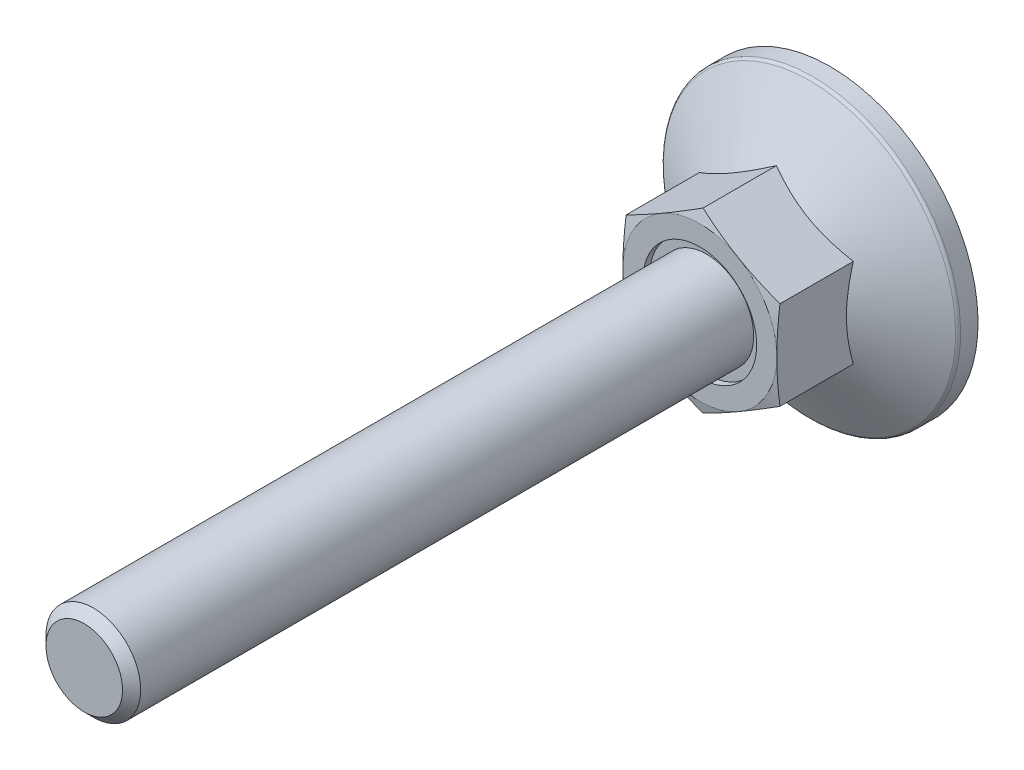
ISO-10303-21;
HEADER;
FILE_DESCRIPTION(('STEP AP214'),'2;1');
FILE_NAME('part.step','',(''),(''),'','','');
FILE_SCHEMA(('AUTOMOTIVE_DESIGN { 1 0 10303 214 1 1 1 1 }'));
ENDSEC;
DATA;
#1=APPLICATION_CONTEXT('core data for automotive mechanical design processes');
#2=APPLICATION_PROTOCOL_DEFINITION('international standard','automotive_design',2000,#1);
#3=PRODUCT_CONTEXT('',#1,'mechanical');
#4=PRODUCT('Part','Part','',(#3));
#5=PRODUCT_RELATED_PRODUCT_CATEGORY('part','',(#4));
#6=PRODUCT_DEFINITION_FORMATION('','',#4);
#7=PRODUCT_DEFINITION_CONTEXT('part definition',#1,'design');
#8=PRODUCT_DEFINITION('design','',#6,#7);
#9=PRODUCT_DEFINITION_SHAPE('','',#8);
#10=(LENGTH_UNIT() NAMED_UNIT(*) SI_UNIT(.MILLI.,.METRE.));
#11=(NAMED_UNIT(*) PLANE_ANGLE_UNIT() SI_UNIT($,.RADIAN.));
#12=(NAMED_UNIT(*) SI_UNIT($,.STERADIAN.) SOLID_ANGLE_UNIT());
#13=UNCERTAINTY_MEASURE_WITH_UNIT(LENGTH_MEASURE(1.E-05),#10,'distance_accuracy_value','');
#14=(GEOMETRIC_REPRESENTATION_CONTEXT(3) GLOBAL_UNCERTAINTY_ASSIGNED_CONTEXT((#13)) GLOBAL_UNIT_ASSIGNED_CONTEXT((#10,
#11,#12)) REPRESENTATION_CONTEXT('',''));
#15=CARTESIAN_POINT('',(0.,0.,0.));
#16=DIRECTION('',(0.,0.,1.));
#17=DIRECTION('',(1.,0.,0.));
#18=AXIS2_PLACEMENT_3D('',#15,#16,#17);
#19=CARTESIAN_POINT('',(0.,0.,10.45));
#20=DIRECTION('',(0.,0.,-1.));
#21=DIRECTION('',(0.,1.,0.));
#22=AXIS2_PLACEMENT_3D('',#19,#20,#21);
#23=PLANE('',#22);
#24=CARTESIAN_POINT('',(0.,0.,10.45));
#25=DIRECTION('',(0.,0.,-1.));
#26=DIRECTION('',(0.,1.,0.));
#27=AXIS2_PLACEMENT_3D('',#24,#25,#26);
#28=CIRCLE('',#27,4.8);
#29=CARTESIAN_POINT('',(0.,4.8,10.45));
#30=VERTEX_POINT('',#29);
#31=EDGE_CURVE('E27',#30,#30,#28,.T.);
#32=ORIENTED_EDGE('',*,*,#31,.F.);
#33=EDGE_LOOP('',(#32));
#34=FACE_BOUND('',#33,.T.);
#35=CARTESIAN_POINT('',(0.,0.,10.45));
#36=DIRECTION('',(0.,0.,-1.));
#37=DIRECTION('',(0.,1.,0.));
#38=AXIS2_PLACEMENT_3D('',#35,#36,#37);
#39=CIRCLE('',#38,4.);
#40=CARTESIAN_POINT('',(0.,4.,10.45));
#41=VERTEX_POINT('',#40);
#42=EDGE_CURVE('E252',#41,#41,#39,.F.);
#43=ORIENTED_EDGE('',*,*,#42,.F.);
#44=EDGE_LOOP('',(#43));
#45=FACE_BOUND('',#44,.T.);
#46=ADVANCED_FACE('F14',(#34,#45),#23,.F.);
#47=CARTESIAN_POINT('',(0.,7.5055534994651,22.));
#48=DIRECTION('',(0.499999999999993,-0.866025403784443,0.));
#49=DIRECTION('',(0.866025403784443,0.499999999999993,0.));
#50=AXIS2_PLACEMENT_3D('',#47,#48,#49);
#51=PLANE('',#50);
#52=CARTESIAN_POINT('',(-6.5002,3.75266127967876,4.53347836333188));
#53=CARTESIAN_POINT('',(-6.35732254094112,3.83515161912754,4.58109719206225));
#54=CARTESIAN_POINT('',(-6.21391236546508,3.91794952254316,4.62655491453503));
#55=CARTESIAN_POINT('',(-5.9259273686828,4.08421773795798,4.71255293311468));
#56=CARTESIAN_POINT('',(-5.78135207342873,4.16768832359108,4.7530911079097));
#57=CARTESIAN_POINT('',(-5.34531134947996,4.41943655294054,4.86653061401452));
#58=CARTESIAN_POINT('',(-5.05212471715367,4.58870793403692,4.93105380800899));
#59=CARTESIAN_POINT('',(-4.61337625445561,4.84201947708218,5.00671503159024));
#60=CARTESIAN_POINT('',(-4.46912536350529,4.92530276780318,5.02826875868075));
#61=CARTESIAN_POINT('',(-4.17997178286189,5.09224566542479,5.06441130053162));
#62=CARTESIAN_POINT('',(-4.03506915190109,5.17590523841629,5.07900073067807));
#63=CARTESIAN_POINT('',(-3.74501222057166,5.34336968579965,5.10084286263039));
#64=CARTESIAN_POINT('',(-3.59985839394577,5.42717428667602,5.10810389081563));
#65=CARTESIAN_POINT('',(-3.30942466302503,5.59485627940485,5.11514131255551));
#66=CARTESIAN_POINT('',(-3.16414476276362,5.67873366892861,5.11491793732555));
#67=CARTESIAN_POINT('',(-2.76612405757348,5.90853103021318,5.1040181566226));
#68=CARTESIAN_POINT('',(-2.51351353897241,6.05437578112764,5.08571979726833));
#69=CARTESIAN_POINT('',(-2.00997032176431,6.34509659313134,5.02769527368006));
#70=CARTESIAN_POINT('',(-1.75903939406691,6.48997163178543,4.9879492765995));
#71=CARTESIAN_POINT('',(-1.25448277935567,6.78127752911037,4.8885957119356));
#72=CARTESIAN_POINT('',(-1.00092075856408,6.92767163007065,4.82856718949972));
#73=CARTESIAN_POINT('',(-0.497578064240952,7.21827667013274,4.69232662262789));
#74=CARTESIAN_POINT('',(-0.247790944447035,7.36249133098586,4.61614658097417));
#75=CARTESIAN_POINT('',(0.000200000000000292,7.50566896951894,4.53347836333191));
#76=B_SPLINE_CURVE_WITH_KNOTS('',3,(#52,#53,#54,#55,#56,#57,#58,#59,#60,#61,#62,#63,#64,#65,#66,
#67,#68,#69,#70,#71,#72,#73,#74,#75),.UNSPECIFIED.,.F.,.F.,(4,2,2,2,2,2,2,2,2,2,2,4),(0.,
0.515105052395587,1.03043143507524,2.06322554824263,2.56697389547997,3.07067772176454,
3.57380860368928,4.07692394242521,4.95279354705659,5.82947446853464,6.72559912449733,
7.61996451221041),.UNSPECIFIED.);
#77=CARTESIAN_POINT('',(-6.5,3.7527767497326,4.53354503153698));
#78=VERTEX_POINT('',#77);
#79=CARTESIAN_POINT('',(0.,7.5055534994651,4.53354503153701));
#80=VERTEX_POINT('',#79);
#81=EDGE_CURVE('E100',#78,#80,#76,.T.);
#82=ORIENTED_EDGE('',*,*,#81,.F.);
#83=DIRECTION('',(0.,0.,-1.));
#84=VECTOR('',#83,1.);
#85=CARTESIAN_POINT('',(-6.5,3.7527767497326,22.));
#86=LINE('',#85,#84);
#87=CARTESIAN_POINT('',(-6.5,3.7527767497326,10.7305627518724));
#88=VERTEX_POINT('',#87);
#89=EDGE_CURVE('E91',#88,#78,#86,.T.);
#90=ORIENTED_EDGE('',*,*,#89,.F.);
#91=CARTESIAN_POINT('',(0.000200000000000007,7.50566896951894,10.7305318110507));
#92=CARTESIAN_POINT('',(-0.269745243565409,7.34981601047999,10.7723102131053));
#93=CARTESIAN_POINT('',(-0.540179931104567,7.19368047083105,10.8102381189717));
#94=CARTESIAN_POINT('',(-1.08200437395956,6.8808579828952,10.876873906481));
#95=CARTESIAN_POINT('',(-1.35339447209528,6.72417083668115,10.9055780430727));
#96=CARTESIAN_POINT('',(-1.89548428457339,6.41119513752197,10.952090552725));
#97=CARTESIAN_POINT('',(-2.16618033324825,6.25490870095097,10.9699543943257));
#98=CARTESIAN_POINT('',(-2.70791763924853,5.94213652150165,10.9939079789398));
#99=CARTESIAN_POINT('',(-2.97895881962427,5.78565082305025,11.));
#100=CARTESIAN_POINT('',(-3.52104118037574,5.47267942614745,11.));
#101=CARTESIAN_POINT('',(-3.79208236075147,5.31619372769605,10.9939079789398));
#102=CARTESIAN_POINT('',(-4.33381966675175,5.00342154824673,10.9699543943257));
#103=CARTESIAN_POINT('',(-4.60451571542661,4.84713511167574,10.952090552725));
#104=CARTESIAN_POINT('',(-5.14660552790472,4.53415941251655,10.9055780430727));
#105=CARTESIAN_POINT('',(-5.41799562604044,4.3774722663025,10.876873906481));
#106=CARTESIAN_POINT('',(-5.95982006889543,4.06464977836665,10.8102381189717));
#107=CARTESIAN_POINT('',(-6.23025475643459,3.90851423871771,10.7723102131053));
#108=CARTESIAN_POINT('',(-6.5002,3.75266127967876,10.7305318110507));
#109=B_SPLINE_CURVE_WITH_KNOTS('',3,(#91,#92,#93,#94,#95,#96,#97,#98,#99,#100,#101,#102,#103,
#104,#105,#106,#107,#108),.UNSPECIFIED.,.F.,.F.,(4,2,2,2,2,2,2,2,4),(0.,0.943529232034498,
1.88744107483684,2.82648138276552,3.76533995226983,4.70419852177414,5.64323882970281,
6.58715067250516,7.53067990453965),.UNSPECIFIED.);
#110=CARTESIAN_POINT('',(-3.24999999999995,5.62916512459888,11.));
#111=VERTEX_POINT('',#110);
#112=EDGE_CURVE('E191',#111,#88,#109,.T.);
#113=ORIENTED_EDGE('',*,*,#112,.F.);
#114=CARTESIAN_POINT('',(0.,7.5055534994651,10.7305627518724));
#115=VERTEX_POINT('',#114);
#116=EDGE_CURVE('E478',#115,#111,#109,.T.);
#117=ORIENTED_EDGE('',*,*,#116,.F.);
#118=DIRECTION('',(0.,0.,-1.));
#119=VECTOR('',#118,1.);
#120=CARTESIAN_POINT('',(0.,7.5055534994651,22.));
#121=LINE('',#120,#119);
#122=EDGE_CURVE('E104',#115,#80,#121,.T.);
#123=ORIENTED_EDGE('',*,*,#122,.T.);
#124=EDGE_LOOP('',(#82,#90,#113,#117,#123));
#125=FACE_BOUND('',#124,.T.);
#126=ADVANCED_FACE('F103',(#125),#51,.F.);
#127=CARTESIAN_POINT('',(6.5,3.7527767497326,22.));
#128=DIRECTION('',(-0.499999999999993,-0.866025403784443,0.));
#129=DIRECTION('',(0.866025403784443,-0.499999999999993,0.));
#130=AXIS2_PLACEMENT_3D('',#127,#128,#129);
#131=PLANE('',#130);
#132=CARTESIAN_POINT('',(-0.0002,7.50566896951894,4.53347836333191));
#133=CARTESIAN_POINT('',(0.142677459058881,7.42317863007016,4.58109719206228));
#134=CARTESIAN_POINT('',(0.286087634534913,7.34038072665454,4.62655491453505));
#135=CARTESIAN_POINT('',(0.574072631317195,7.17411251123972,4.71255293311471));
#136=CARTESIAN_POINT('',(0.718647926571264,7.09064192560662,4.75309110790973));
#137=CARTESIAN_POINT('',(1.15468865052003,6.83889369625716,4.86653061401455));
#138=CARTESIAN_POINT('',(1.44787528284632,6.66962231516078,4.93105380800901));
#139=CARTESIAN_POINT('',(1.88662374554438,6.41631077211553,5.00671503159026));
#140=CARTESIAN_POINT('',(2.03087463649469,6.33302748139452,5.02826875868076));
#141=CARTESIAN_POINT('',(2.32002821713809,6.16608458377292,5.06441130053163));
#142=CARTESIAN_POINT('',(2.46493084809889,6.08242501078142,5.07900073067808));
#143=CARTESIAN_POINT('',(2.75498777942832,5.91496056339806,5.10084286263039));
#144=CARTESIAN_POINT('',(2.90014160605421,5.8311559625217,5.10810389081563));
#145=CARTESIAN_POINT('',(3.19057533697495,5.66347396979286,5.11514131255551));
#146=CARTESIAN_POINT('',(3.33585523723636,5.5795965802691,5.11491793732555));
#147=CARTESIAN_POINT('',(3.73387594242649,5.34979921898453,5.10401815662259));
#148=CARTESIAN_POINT('',(3.98648646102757,5.20395446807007,5.08571979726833));
#149=CARTESIAN_POINT('',(4.49002967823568,4.91323365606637,5.02769527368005));
#150=CARTESIAN_POINT('',(4.74096060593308,4.76835861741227,4.98794927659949));
#151=CARTESIAN_POINT('',(5.24551722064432,4.47705272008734,4.88859571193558));
#152=CARTESIAN_POINT('',(5.49907924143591,4.33065861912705,4.8285671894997));
#153=CARTESIAN_POINT('',(6.00242193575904,4.04005357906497,4.69232662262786));
#154=CARTESIAN_POINT('',(6.25220905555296,3.89583891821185,4.61614658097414));
#155=CARTESIAN_POINT('',(6.5002,3.75266127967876,4.53347836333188));
#156=B_SPLINE_CURVE_WITH_KNOTS('',3,(#132,#133,#134,#135,#136,#137,#138,#139,#140,#141,#142,
#143,#144,#145,#146,#147,#148,#149,#150,#151,#152,#153,#154,#155),.UNSPECIFIED.,.F.,.F.,(4,2,2,
2,2,2,2,2,2,2,2,4),(0.,0.515105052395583,1.03043143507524,2.06322554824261,2.56697389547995,
3.07067772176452,3.57380860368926,4.07692394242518,4.95279354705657,5.82947446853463,
6.72559912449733,7.61996451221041),.UNSPECIFIED.);
#157=CARTESIAN_POINT('',(6.5,3.7527767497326,4.53354503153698));
#158=VERTEX_POINT('',#157);
#159=EDGE_CURVE('E34',#80,#158,#156,.T.);
#160=ORIENTED_EDGE('',*,*,#159,.F.);
#161=ORIENTED_EDGE('',*,*,#122,.F.);
#162=CARTESIAN_POINT('',(6.5002,3.75266127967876,10.7305318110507));
#163=CARTESIAN_POINT('',(6.23025475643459,3.90851423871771,10.7723102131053));
#164=CARTESIAN_POINT('',(5.95982006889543,4.06464977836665,10.8102381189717));
#165=CARTESIAN_POINT('',(5.41799562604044,4.37747226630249,10.876873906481));
#166=CARTESIAN_POINT('',(5.14660552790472,4.53415941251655,10.9055780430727));
#167=CARTESIAN_POINT('',(4.60451571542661,4.84713511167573,10.952090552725));
#168=CARTESIAN_POINT('',(4.33381966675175,5.00342154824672,10.9699543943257));
#169=CARTESIAN_POINT('',(3.79208236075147,5.31619372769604,10.9939079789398));
#170=CARTESIAN_POINT('',(3.52104118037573,5.47267942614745,11.));
#171=CARTESIAN_POINT('',(2.97895881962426,5.78565082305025,11.));
#172=CARTESIAN_POINT('',(2.70791763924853,5.94213652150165,10.9939079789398));
#173=CARTESIAN_POINT('',(2.16618033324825,6.25490870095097,10.9699543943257));
#174=CARTESIAN_POINT('',(1.89548428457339,6.41119513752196,10.952090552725));
#175=CARTESIAN_POINT('',(1.35339447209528,6.72417083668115,10.9055780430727));
#176=CARTESIAN_POINT('',(1.08200437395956,6.8808579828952,10.876873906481));
#177=CARTESIAN_POINT('',(0.540179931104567,7.19368047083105,10.8102381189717));
#178=CARTESIAN_POINT('',(0.26974524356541,7.34981601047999,10.7723102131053));
#179=CARTESIAN_POINT('',(-0.000199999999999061,7.50566896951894,10.7305318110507));
#180=B_SPLINE_CURVE_WITH_KNOTS('',3,(#162,#163,#164,#165,#166,#167,#168,#169,#170,#171,#172,
#173,#174,#175,#176,#177,#178,#179),.UNSPECIFIED.,.F.,.F.,(4,2,2,2,2,2,2,2,4),(0.,
0.943529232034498,1.88744107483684,2.82648138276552,3.76533995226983,4.70419852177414,
5.64323882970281,6.58715067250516,7.53067990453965),.UNSPECIFIED.);
#181=CARTESIAN_POINT('',(3.24999999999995,5.62916512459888,11.));
#182=VERTEX_POINT('',#181);
#183=EDGE_CURVE('E175',#182,#115,#180,.T.);
#184=ORIENTED_EDGE('',*,*,#183,.F.);
#185=CARTESIAN_POINT('',(6.5,3.7527767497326,10.7305627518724));
#186=VERTEX_POINT('',#185);
#187=EDGE_CURVE('E183',#186,#182,#180,.T.);
#188=ORIENTED_EDGE('',*,*,#187,.F.);
#189=DIRECTION('',(0.,0.,-1.));
#190=VECTOR('',#189,1.);
#191=CARTESIAN_POINT('',(6.5,3.7527767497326,22.));
#192=LINE('',#191,#190);
#193=EDGE_CURVE('E481',#186,#158,#192,.T.);
#194=ORIENTED_EDGE('',*,*,#193,.T.);
#195=EDGE_LOOP('',(#160,#161,#184,#188,#194));
#196=FACE_BOUND('',#195,.T.);
#197=ADVANCED_FACE('F165',(#196),#131,.F.);
#198=CARTESIAN_POINT('',(6.5,-3.7527767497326,22.));
#199=DIRECTION('',(-1.,0.,0.));
#200=DIRECTION('',(0.,-1.,0.));
#201=AXIS2_PLACEMENT_3D('',#198,#199,#200);
#202=PLANE('',#201);
#203=CARTESIAN_POINT('',(6.5,10.067414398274,1.94823609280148));
#204=CARTESIAN_POINT('',(6.5,9.78352438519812,2.0858958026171));
#205=CARTESIAN_POINT('',(6.5,9.49898106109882,2.22223138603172));
#206=CARTESIAN_POINT('',(6.5,8.9282401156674,2.49150895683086));
#207=CARTESIAN_POINT('',(6.5,8.64204224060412,2.62445040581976));
#208=CARTESIAN_POINT('',(6.5,8.06616487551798,2.88686541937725));
#209=CARTESIAN_POINT('',(6.5,7.77647490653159,3.01631606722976));
#210=CARTESIAN_POINT('',(6.5,7.19478507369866,3.26989907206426));
#211=CARTESIAN_POINT('',(6.5,6.90278532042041,3.3940316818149));
#212=CARTESIAN_POINT('',(6.5,6.30684739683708,3.6393457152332));
#213=CARTESIAN_POINT('',(6.5,6.00282105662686,3.76031411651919));
#214=CARTESIAN_POINT('',(6.5,5.39120706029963,3.99306391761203));
#215=CARTESIAN_POINT('',(6.5,5.08361900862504,4.10484428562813));
#216=CARTESIAN_POINT('',(6.5,4.46497231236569,4.31627594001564));
#217=CARTESIAN_POINT('',(6.5,4.15392216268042,4.41595183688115));
#218=CARTESIAN_POINT('',(6.5,3.52735818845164,4.59996747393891));
#219=CARTESIAN_POINT('',(6.5,3.21184580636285,4.6843120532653));
#220=CARTESIAN_POINT('',(6.5,2.57783458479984,4.83319256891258));
#221=CARTESIAN_POINT('',(6.5,2.25935972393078,4.8978289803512));
#222=CARTESIAN_POINT('',(6.5,1.61842059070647,5.00357646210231));
#223=CARTESIAN_POINT('',(6.5,1.29595672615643,5.04468991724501));
#224=CARTESIAN_POINT('',(6.5,0.812693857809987,5.08598811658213));
#225=CARTESIAN_POINT('',(6.5,0.652724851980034,5.09635596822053));
#226=CARTESIAN_POINT('',(6.5,0.332484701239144,5.110324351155));
#227=CARTESIAN_POINT('',(6.5,0.172213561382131,5.11392499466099));
#228=CARTESIAN_POINT('',(6.5,-0.148338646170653,5.11426557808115));
#229=CARTESIAN_POINT('',(6.5,-0.308619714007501,5.11100536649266));
#230=CARTESIAN_POINT('',(6.5,-0.628902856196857,5.09770543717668));
#231=CARTESIAN_POINT('',(6.5,-0.788904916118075,5.08766537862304));
#232=CARTESIAN_POINT('',(6.5,-1.1736673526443,5.05558094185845));
#233=CARTESIAN_POINT('',(6.5,-1.39816400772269,5.03030719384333));
#234=CARTESIAN_POINT('',(6.5,-1.84547349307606,4.96779217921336));
#235=CARTESIAN_POINT('',(6.5,-2.06828609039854,4.93054928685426));
#236=CARTESIAN_POINT('',(6.5,-2.73393776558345,4.80284369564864));
#237=CARTESIAN_POINT('',(6.5,-3.17375537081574,4.69642628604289));
#238=CARTESIAN_POINT('',(6.5,-3.83171733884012,4.51203063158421));
#239=CARTESIAN_POINT('',(6.5,-4.0532725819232,4.44552609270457));
#240=CARTESIAN_POINT('',(6.5,-4.49422901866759,4.30565892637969));
#241=CARTESIAN_POINT('',(6.5,-4.7136301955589,4.23229624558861));
#242=CARTESIAN_POINT('',(6.5,-5.15035386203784,4.07988627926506));
#243=CARTESIAN_POINT('',(6.5,-5.36767698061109,4.00084077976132));
#244=CARTESIAN_POINT('',(6.5,-5.800520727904,3.83799065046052));
#245=CARTESIAN_POINT('',(6.5,-6.01604140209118,3.75418614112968));
#246=CARTESIAN_POINT('',(6.5,-6.61842771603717,3.5135303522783));
#247=CARTESIAN_POINT('',(6.5,-7.00350435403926,3.35220459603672));
#248=CARTESIAN_POINT('',(6.5,-7.76959629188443,3.02014813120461));
#249=CARTESIAN_POINT('',(6.5,-8.15061109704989,2.84941629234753));
#250=CARTESIAN_POINT('',(6.5,-8.90957192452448,2.50088582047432));
#251=CARTESIAN_POINT('',(6.5,-9.28751663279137,2.32308433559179));
#252=CARTESIAN_POINT('',(6.5,-10.0408394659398,1.96218611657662));
#253=CARTESIAN_POINT('',(6.5,-10.4162177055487,1.77908962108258));
#254=CARTESIAN_POINT('',(6.5,-11.1655631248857,1.40849620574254));
#255=CARTESIAN_POINT('',(6.5,-11.5395269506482,1.22099251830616));
#256=CARTESIAN_POINT('',(6.5,-12.2858210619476,0.842758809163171));
#257=CARTESIAN_POINT('',(6.5,-12.6581513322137,0.652028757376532));
#258=CARTESIAN_POINT('',(6.5,-13.4013949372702,0.268043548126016));
#259=CARTESIAN_POINT('',(6.5,-13.7723085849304,0.0747889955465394));
#260=CARTESIAN_POINT('',(6.5,-14.5130449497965,-0.313800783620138));
#261=CARTESIAN_POINT('',(6.5,-14.8828676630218,-0.509136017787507));
#262=CARTESIAN_POINT('',(6.5,-15.9085714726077,-1.05391022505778));
#263=CARTESIAN_POINT('',(6.5,-16.5634819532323,-1.40517623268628));
#264=CARTESIAN_POINT('',(6.5,-17.871267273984,-2.11157255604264));
#265=CARTESIAN_POINT('',(6.5,-18.5241419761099,-2.46670312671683));
#266=CARTESIAN_POINT('',(6.5,-19.8261496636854,-3.17862531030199));
#267=CARTESIAN_POINT('',(6.5,-20.4752878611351,-3.53540739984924));
#268=CARTESIAN_POINT('',(6.5,-21.7722968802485,-4.25114422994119));
#269=CARTESIAN_POINT('',(6.5,-22.4201678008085,-4.61009879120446));
#270=CARTESIAN_POINT('',(6.5,-23.0675997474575,-4.9698379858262));
#271=B_SPLINE_CURVE_WITH_KNOTS('',3,(#203,#204,#205,#206,#207,#208,#209,#210,#211,#212,#213,
#214,#215,#216,#217,#218,#219,#220,#221,#222,#223,#224,#225,#226,#227,#228,#229,#230,#231,#232,
#233,#234,#235,#236,#237,#238,#239,#240,#241,#242,#243,#244,#245,#246,#247,#248,#249,#250,#251,
#252,#253,#254,#255,#256,#257,#258,#259,#260,#261,#262,#263,#264,#265,#266,#267,#268,#269,#270),
.UNSPECIFIED.,.F.,.F.,(4,2,2,2,2,2,2,2,2,2,2,2,2,2,2,2,2,2,2,2,2,2,2,2,2,2,2,2,2,2,2,2,2,4),(0.,
0.94652822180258,1.89320566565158,2.84505559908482,3.79686024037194,4.77837094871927,
5.75999172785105,6.73958204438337,7.71886262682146,8.69306383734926,9.66716626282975,
10.1479587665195,10.6287432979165,11.1095384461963,11.5903577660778,12.267719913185,
12.9451741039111,14.3007885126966,14.9946950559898,15.6886069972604,16.3823017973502,
17.0759790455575,18.3282990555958,19.5807698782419,20.8337511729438,22.086676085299,
23.3416700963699,24.5966758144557,25.8513861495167,27.1061010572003,29.3355785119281,
31.5652039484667,33.7873748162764,36.0093647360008),.UNSPECIFIED.);
#272=CARTESIAN_POINT('',(6.5,-3.7527767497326,4.53354503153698));
#273=VERTEX_POINT('',#272);
#274=EDGE_CURVE('E42',#158,#273,#271,.T.);
#275=ORIENTED_EDGE('',*,*,#274,.F.);
#276=ORIENTED_EDGE('',*,*,#193,.F.);
#277=CARTESIAN_POINT('',(6.5,9.92747995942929,9.56215186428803));
#278=CARTESIAN_POINT('',(6.5,9.63259364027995,9.62823955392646));
#279=CARTESIAN_POINT('',(6.5,9.33752287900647,9.69351898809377));
#280=CARTESIAN_POINT('',(6.5,8.74692189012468,9.82202506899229));
#281=CARTESIAN_POINT('',(6.5,8.45139164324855,9.88525162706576));
#282=CARTESIAN_POINT('',(6.5,7.85951636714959,10.0092707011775));
#283=CARTESIAN_POINT('',(6.5,7.56317082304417,10.0700607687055));
#284=CARTESIAN_POINT('',(6.5,6.9698629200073,10.1885506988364));
#285=CARTESIAN_POINT('',(6.5,6.67290056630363,10.2462505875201));
#286=CARTESIAN_POINT('',(6.5,6.08062010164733,10.3573796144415));
#287=CARTESIAN_POINT('',(6.5,5.78530770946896,10.410839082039));
#288=CARTESIAN_POINT('',(6.5,5.19387740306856,10.5130907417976));
#289=CARTESIAN_POINT('',(6.5,4.89775950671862,10.5618830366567));
#290=CARTESIAN_POINT('',(6.5,4.30466070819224,10.6537017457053));
#291=CARTESIAN_POINT('',(6.5,4.00767991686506,10.69672886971));
#292=CARTESIAN_POINT('',(6.5,3.41277328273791,10.7757492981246));
#293=CARTESIAN_POINT('',(6.5,3.11484743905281,10.8117425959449));
#294=CARTESIAN_POINT('',(6.5,2.51468954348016,10.8756761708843));
#295=CARTESIAN_POINT('',(6.5,2.21244707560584,10.9035201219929));
#296=CARTESIAN_POINT('',(6.5,1.60720229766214,10.9492341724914));
#297=CARTESIAN_POINT('',(6.5,1.30420000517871,10.9671045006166));
#298=CARTESIAN_POINT('',(6.5,0.697875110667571,10.9918290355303));
#299=CARTESIAN_POINT('',(6.5,0.394552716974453,10.9986882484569));
#300=CARTESIAN_POINT('',(6.5,-0.212135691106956,11.0009688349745));
#301=CARTESIAN_POINT('',(6.5,-0.515501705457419,10.9963902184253));
#302=CARTESIAN_POINT('',(6.5,-1.1229550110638,10.9760526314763));
#303=CARTESIAN_POINT('',(6.5,-1.42704091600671,10.9602530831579));
#304=CARTESIAN_POINT('',(6.5,-2.03449758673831,10.918375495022));
#305=CARTESIAN_POINT('',(6.5,-2.33786833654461,10.892297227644));
#306=CARTESIAN_POINT('',(6.5,-2.94389214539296,10.8311794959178));
#307=CARTESIAN_POINT('',(6.5,-3.24654460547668,10.7961341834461));
#308=CARTESIAN_POINT('',(6.5,-3.85087551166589,10.7185406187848));
#309=CARTESIAN_POINT('',(6.5,-4.15255395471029,10.6759923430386));
#310=CARTESIAN_POINT('',(6.5,-4.73502363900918,10.5877746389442));
#311=CARTESIAN_POINT('',(6.5,-5.01587505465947,10.5424985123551));
#312=CARTESIAN_POINT('',(6.5,-5.57683763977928,10.4475514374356));
#313=CARTESIAN_POINT('',(6.5,-5.85694878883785,10.3978803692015));
#314=CARTESIAN_POINT('',(6.5,-6.41653333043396,10.2949474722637));
#315=CARTESIAN_POINT('',(6.5,-6.69600666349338,10.2416853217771));
#316=CARTESIAN_POINT('',(6.5,-7.25437933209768,10.132225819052));
#317=CARTESIAN_POINT('',(6.5,-7.53327866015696,10.0760284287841));
#318=CARTESIAN_POINT('',(6.5,-8.36936246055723,9.90383082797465));
#319=CARTESIAN_POINT('',(6.5,-8.9258084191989,9.78424858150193));
#320=CARTESIAN_POINT('',(6.5,-10.0372205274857,9.53861051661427));
#321=CARTESIAN_POINT('',(6.5,-10.5921867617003,9.41255507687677));
#322=CARTESIAN_POINT('',(6.5,-11.6956125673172,9.15714489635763));
#323=CARTESIAN_POINT('',(6.5,-12.244082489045,9.02783474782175));
#324=CARTESIAN_POINT('',(6.5,-13.3402571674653,8.76597711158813));
#325=CARTESIAN_POINT('',(6.5,-13.8879619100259,8.6334295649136));
#326=CARTESIAN_POINT('',(6.5,-14.9821103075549,8.36610757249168));
#327=CARTESIAN_POINT('',(6.5,-15.528554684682,8.23133607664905));
#328=CARTESIAN_POINT('',(6.5,-16.6209674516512,7.95995280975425));
#329=CARTESIAN_POINT('',(6.5,-17.1669358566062,7.82334109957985));
#330=CARTESIAN_POINT('',(6.5,-17.7127383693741,7.6860776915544));
#331=B_SPLINE_CURVE_WITH_KNOTS('',3,(#277,#278,#279,#280,#281,#282,#283,#284,#285,#286,#287,
#288,#289,#290,#291,#292,#293,#294,#295,#296,#297,#298,#299,#300,#301,#302,#303,#304,#305,#306,
#307,#308,#309,#310,#311,#312,#313,#314,#315,#316,#317,#318,#319,#320,#321,#322,#323,#324,#325,
#326,#327,#328,#329,#330),.UNSPECIFIED.,.F.,.F.,(4,2,2,2,2,2,2,2,2,2,2,2,2,2,2,2,2,2,2,2,2,2,2,
2,2,2,4),(0.,0.906607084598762,1.8132532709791,2.72078883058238,3.62831672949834,
4.52862337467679,5.42891020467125,6.32908608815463,7.22926281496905,8.13968571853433,
9.05008774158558,9.96007573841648,10.8700629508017,11.7833577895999,12.6966728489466,
13.6105850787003,14.5245001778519,15.3778915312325,16.2313061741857,17.084797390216,
17.9382996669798,19.6456836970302,21.3529679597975,23.0434756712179,24.7340142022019,
26.4224665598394,28.1108631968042),.UNSPECIFIED.);
#332=CARTESIAN_POINT('',(6.5,0.,11.));
#333=VERTEX_POINT('',#332);
#334=EDGE_CURVE('E185',#333,#186,#331,.F.);
#335=ORIENTED_EDGE('',*,*,#334,.F.);
#336=CARTESIAN_POINT('',(6.5,-3.7527767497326,10.7305627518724));
#337=VERTEX_POINT('',#336);
#338=EDGE_CURVE('E184',#337,#333,#331,.F.);
#339=ORIENTED_EDGE('',*,*,#338,.F.);
#340=DIRECTION('',(0.,0.,-1.));
#341=VECTOR('',#340,1.);
#342=CARTESIAN_POINT('',(6.5,-3.7527767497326,22.));
#343=LINE('',#342,#341);
#344=EDGE_CURVE('E453',#337,#273,#343,.T.);
#345=ORIENTED_EDGE('',*,*,#344,.T.);
#346=EDGE_LOOP('',(#275,#276,#335,#339,#345));
#347=FACE_BOUND('',#346,.T.);
#348=ADVANCED_FACE('F169',(#347),#202,.F.);
#349=CARTESIAN_POINT('',(0.,-7.5055534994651,22.));
#350=DIRECTION('',(-0.499999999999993,0.866025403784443,0.));
#351=DIRECTION('',(-0.866025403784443,-0.499999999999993,0.));
#352=AXIS2_PLACEMENT_3D('',#349,#350,#351);
#353=PLANE('',#352);
#354=CARTESIAN_POINT('',(6.5002,-3.75266127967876,4.53347836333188));
#355=CARTESIAN_POINT('',(6.35732254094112,-3.83515161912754,4.58109719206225));
#356=CARTESIAN_POINT('',(6.21391236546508,-3.91794952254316,4.62655491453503));
#357=CARTESIAN_POINT('',(5.9259273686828,-4.08421773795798,4.71255293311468));
#358=CARTESIAN_POINT('',(5.78135207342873,-4.16768832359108,4.7530911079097));
#359=CARTESIAN_POINT('',(5.34531134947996,-4.41943655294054,4.86653061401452));
#360=CARTESIAN_POINT('',(5.05212471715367,-4.58870793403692,4.93105380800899));
#361=CARTESIAN_POINT('',(4.61337625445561,-4.84201947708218,5.00671503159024));
#362=CARTESIAN_POINT('',(4.46912536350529,-4.92530276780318,5.02826875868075));
#363=CARTESIAN_POINT('',(4.17997178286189,-5.09224566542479,5.06441130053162));
#364=CARTESIAN_POINT('',(4.03506915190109,-5.17590523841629,5.07900073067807));
#365=CARTESIAN_POINT('',(3.74501222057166,-5.34336968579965,5.10084286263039));
#366=CARTESIAN_POINT('',(3.59985839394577,-5.42717428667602,5.10810389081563));
#367=CARTESIAN_POINT('',(3.30942466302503,-5.59485627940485,5.11514131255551));
#368=CARTESIAN_POINT('',(3.16414476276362,-5.67873366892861,5.11491793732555));
#369=CARTESIAN_POINT('',(2.76612405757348,-5.90853103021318,5.1040181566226));
#370=CARTESIAN_POINT('',(2.51351353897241,-6.05437578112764,5.08571979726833));
#371=CARTESIAN_POINT('',(2.00997032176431,-6.34509659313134,5.02769527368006));
#372=CARTESIAN_POINT('',(1.75903939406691,-6.48997163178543,4.9879492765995));
#373=CARTESIAN_POINT('',(1.25448277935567,-6.78127752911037,4.8885957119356));
#374=CARTESIAN_POINT('',(1.00092075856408,-6.92767163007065,4.82856718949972));
#375=CARTESIAN_POINT('',(0.497578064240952,-7.21827667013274,4.69232662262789));
#376=CARTESIAN_POINT('',(0.247790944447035,-7.36249133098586,4.61614658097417));
#377=CARTESIAN_POINT('',(-0.000200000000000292,-7.50566896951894,4.53347836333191));
#378=B_SPLINE_CURVE_WITH_KNOTS('',3,(#354,#355,#356,#357,#358,#359,#360,#361,#362,#363,#364,
#365,#366,#367,#368,#369,#370,#371,#372,#373,#374,#375,#376,#377),.UNSPECIFIED.,.F.,.F.,(4,2,2,
2,2,2,2,2,2,2,2,4),(0.,0.515105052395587,1.03043143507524,2.06322554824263,2.56697389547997,
3.07067772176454,3.57380860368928,4.07692394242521,4.95279354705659,5.82947446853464,
6.72559912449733,7.61996451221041),.UNSPECIFIED.);
#379=CARTESIAN_POINT('',(0.,-7.5055534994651,4.53354503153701));
#380=VERTEX_POINT('',#379);
#381=EDGE_CURVE('E112',#273,#380,#378,.T.);
#382=ORIENTED_EDGE('',*,*,#381,.F.);
#383=ORIENTED_EDGE('',*,*,#344,.F.);
#384=CARTESIAN_POINT('',(-0.000200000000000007,-7.50566896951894,10.7305318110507));
#385=CARTESIAN_POINT('',(0.269745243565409,-7.34981601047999,10.7723102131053));
#386=CARTESIAN_POINT('',(0.540179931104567,-7.19368047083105,10.8102381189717));
#387=CARTESIAN_POINT('',(1.08200437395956,-6.8808579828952,10.876873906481));
#388=CARTESIAN_POINT('',(1.35339447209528,-6.72417083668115,10.9055780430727));
#389=CARTESIAN_POINT('',(1.89548428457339,-6.41119513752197,10.952090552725));
#390=CARTESIAN_POINT('',(2.16618033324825,-6.25490870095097,10.9699543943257));
#391=CARTESIAN_POINT('',(2.70791763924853,-5.94213652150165,10.9939079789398));
#392=CARTESIAN_POINT('',(2.97895881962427,-5.78565082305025,11.));
#393=CARTESIAN_POINT('',(3.52104118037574,-5.47267942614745,11.));
#394=CARTESIAN_POINT('',(3.79208236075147,-5.31619372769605,10.9939079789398));
#395=CARTESIAN_POINT('',(4.33381966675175,-5.00342154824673,10.9699543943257));
#396=CARTESIAN_POINT('',(4.60451571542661,-4.84713511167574,10.952090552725));
#397=CARTESIAN_POINT('',(5.14660552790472,-4.53415941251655,10.9055780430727));
#398=CARTESIAN_POINT('',(5.41799562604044,-4.3774722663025,10.876873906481));
#399=CARTESIAN_POINT('',(5.95982006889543,-4.06464977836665,10.8102381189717));
#400=CARTESIAN_POINT('',(6.23025475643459,-3.90851423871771,10.7723102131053));
#401=CARTESIAN_POINT('',(6.5002,-3.75266127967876,10.7305318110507));
#402=B_SPLINE_CURVE_WITH_KNOTS('',3,(#384,#385,#386,#387,#388,#389,#390,#391,#392,#393,#394,
#395,#396,#397,#398,#399,#400,#401),.UNSPECIFIED.,.F.,.F.,(4,2,2,2,2,2,2,2,4),(0.,
0.943529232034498,1.88744107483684,2.82648138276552,3.76533995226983,4.70419852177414,
5.64323882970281,6.58715067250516,7.53067990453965),.UNSPECIFIED.);
#403=CARTESIAN_POINT('',(3.24999999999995,-5.62916512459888,11.));
#404=VERTEX_POINT('',#403);
#405=EDGE_CURVE('E222',#404,#337,#402,.T.);
#406=ORIENTED_EDGE('',*,*,#405,.F.);
#407=CARTESIAN_POINT('',(0.,-7.5055534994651,10.7305627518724));
#408=VERTEX_POINT('',#407);
#409=EDGE_CURVE('E228',#408,#404,#402,.T.);
#410=ORIENTED_EDGE('',*,*,#409,.F.);
#411=DIRECTION('',(0.,0.,-1.));
#412=VECTOR('',#411,1.);
#413=CARTESIAN_POINT('',(0.,-7.5055534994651,22.));
#414=LINE('',#413,#412);
#415=EDGE_CURVE('E483',#408,#380,#414,.T.);
#416=ORIENTED_EDGE('',*,*,#415,.T.);
#417=EDGE_LOOP('',(#382,#383,#406,#410,#416));
#418=FACE_BOUND('',#417,.T.);
#419=ADVANCED_FACE('F230',(#418),#353,.F.);
#420=CARTESIAN_POINT('',(-6.5,-3.7527767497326,22.));
#421=DIRECTION('',(0.499999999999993,0.866025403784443,0.));
#422=DIRECTION('',(-0.866025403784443,0.499999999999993,0.));
#423=AXIS2_PLACEMENT_3D('',#420,#421,#422);
#424=PLANE('',#423);
#425=CARTESIAN_POINT('',(0.0002,-7.50566896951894,4.53347836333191));
#426=CARTESIAN_POINT('',(-0.142677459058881,-7.42317863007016,4.58109719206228));
#427=CARTESIAN_POINT('',(-0.286087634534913,-7.34038072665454,4.62655491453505));
#428=CARTESIAN_POINT('',(-0.574072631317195,-7.17411251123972,4.71255293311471));
#429=CARTESIAN_POINT('',(-0.718647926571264,-7.09064192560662,4.75309110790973));
#430=CARTESIAN_POINT('',(-1.15468865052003,-6.83889369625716,4.86653061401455));
#431=CARTESIAN_POINT('',(-1.44787528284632,-6.66962231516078,4.93105380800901));
#432=CARTESIAN_POINT('',(-1.88662374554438,-6.41631077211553,5.00671503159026));
#433=CARTESIAN_POINT('',(-2.03087463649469,-6.33302748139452,5.02826875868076));
#434=CARTESIAN_POINT('',(-2.32002821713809,-6.16608458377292,5.06441130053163));
#435=CARTESIAN_POINT('',(-2.46493084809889,-6.08242501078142,5.07900073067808));
#436=CARTESIAN_POINT('',(-2.75498777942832,-5.91496056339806,5.10084286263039));
#437=CARTESIAN_POINT('',(-2.90014160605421,-5.8311559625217,5.10810389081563));
#438=CARTESIAN_POINT('',(-3.19057533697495,-5.66347396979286,5.11514131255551));
#439=CARTESIAN_POINT('',(-3.33585523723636,-5.5795965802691,5.11491793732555));
#440=CARTESIAN_POINT('',(-3.73387594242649,-5.34979921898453,5.10401815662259));
#441=CARTESIAN_POINT('',(-3.98648646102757,-5.20395446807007,5.08571979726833));
#442=CARTESIAN_POINT('',(-4.49002967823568,-4.91323365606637,5.02769527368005));
#443=CARTESIAN_POINT('',(-4.74096060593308,-4.76835861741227,4.98794927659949));
#444=CARTESIAN_POINT('',(-5.24551722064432,-4.47705272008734,4.88859571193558));
#445=CARTESIAN_POINT('',(-5.49907924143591,-4.33065861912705,4.8285671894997));
#446=CARTESIAN_POINT('',(-6.00242193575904,-4.04005357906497,4.69232662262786));
#447=CARTESIAN_POINT('',(-6.25220905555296,-3.89583891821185,4.61614658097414));
#448=CARTESIAN_POINT('',(-6.5002,-3.75266127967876,4.53347836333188));
#449=B_SPLINE_CURVE_WITH_KNOTS('',3,(#425,#426,#427,#428,#429,#430,#431,#432,#433,#434,#435,
#436,#437,#438,#439,#440,#441,#442,#443,#444,#445,#446,#447,#448),.UNSPECIFIED.,.F.,.F.,(4,2,2,
2,2,2,2,2,2,2,2,4),(0.,0.515105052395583,1.03043143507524,2.06322554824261,2.56697389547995,
3.07067772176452,3.57380860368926,4.07692394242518,4.95279354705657,5.82947446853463,
6.72559912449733,7.61996451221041),.UNSPECIFIED.);
#450=CARTESIAN_POINT('',(-6.5,-3.7527767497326,4.53354503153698));
#451=VERTEX_POINT('',#450);
#452=EDGE_CURVE('E110',#380,#451,#449,.T.);
#453=ORIENTED_EDGE('',*,*,#452,.F.);
#454=ORIENTED_EDGE('',*,*,#415,.F.);
#455=CARTESIAN_POINT('',(-6.5002,-3.75266127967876,10.7305318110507));
#456=CARTESIAN_POINT('',(-6.23025475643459,-3.90851423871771,10.7723102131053));
#457=CARTESIAN_POINT('',(-5.95982006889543,-4.06464977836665,10.8102381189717));
#458=CARTESIAN_POINT('',(-5.41799562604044,-4.37747226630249,10.876873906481));
#459=CARTESIAN_POINT('',(-5.14660552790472,-4.53415941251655,10.9055780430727));
#460=CARTESIAN_POINT('',(-4.60451571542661,-4.84713511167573,10.952090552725));
#461=CARTESIAN_POINT('',(-4.33381966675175,-5.00342154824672,10.9699543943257));
#462=CARTESIAN_POINT('',(-3.79208236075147,-5.31619372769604,10.9939079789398));
#463=CARTESIAN_POINT('',(-3.52104118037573,-5.47267942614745,11.));
#464=CARTESIAN_POINT('',(-2.97895881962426,-5.78565082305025,11.));
#465=CARTESIAN_POINT('',(-2.70791763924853,-5.94213652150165,10.9939079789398));
#466=CARTESIAN_POINT('',(-2.16618033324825,-6.25490870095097,10.9699543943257));
#467=CARTESIAN_POINT('',(-1.89548428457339,-6.41119513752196,10.952090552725));
#468=CARTESIAN_POINT('',(-1.35339447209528,-6.72417083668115,10.9055780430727));
#469=CARTESIAN_POINT('',(-1.08200437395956,-6.8808579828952,10.876873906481));
#470=CARTESIAN_POINT('',(-0.540179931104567,-7.19368047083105,10.8102381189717));
#471=CARTESIAN_POINT('',(-0.26974524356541,-7.34981601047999,10.7723102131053));
#472=CARTESIAN_POINT('',(0.000199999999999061,-7.50566896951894,10.7305318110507));
#473=B_SPLINE_CURVE_WITH_KNOTS('',3,(#455,#456,#457,#458,#459,#460,#461,#462,#463,#464,#465,
#466,#467,#468,#469,#470,#471,#472),.UNSPECIFIED.,.F.,.F.,(4,2,2,2,2,2,2,2,4),(0.,
0.943529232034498,1.88744107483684,2.82648138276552,3.76533995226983,4.70419852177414,
5.64323882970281,6.58715067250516,7.53067990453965),.UNSPECIFIED.);
#474=CARTESIAN_POINT('',(-3.24999999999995,-5.62916512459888,11.));
#475=VERTEX_POINT('',#474);
#476=EDGE_CURVE('E216',#475,#408,#473,.T.);
#477=ORIENTED_EDGE('',*,*,#476,.F.);
#478=CARTESIAN_POINT('',(-6.5,-3.7527767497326,10.7305627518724));
#479=VERTEX_POINT('',#478);
#480=EDGE_CURVE('E229',#479,#475,#473,.T.);
#481=ORIENTED_EDGE('',*,*,#480,.F.);
#482=DIRECTION('',(0.,0.,-1.));
#483=VECTOR('',#482,1.);
#484=CARTESIAN_POINT('',(-6.5,-3.7527767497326,22.));
#485=LINE('',#484,#483);
#486=EDGE_CURVE('E99',#479,#451,#485,.T.);
#487=ORIENTED_EDGE('',*,*,#486,.T.);
#488=EDGE_LOOP('',(#453,#454,#477,#481,#487));
#489=FACE_BOUND('',#488,.T.);
#490=ADVANCED_FACE('F134',(#489),#424,.F.);
#491=CARTESIAN_POINT('',(-6.5,3.7527767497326,22.));
#492=DIRECTION('',(1.,0.,0.));
#493=DIRECTION('',(0.,1.,0.));
#494=AXIS2_PLACEMENT_3D('',#491,#492,#493);
#495=PLANE('',#494);
#496=CARTESIAN_POINT('',(-6.5,10.067414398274,1.94823609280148));
#497=CARTESIAN_POINT('',(-6.5,9.78352438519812,2.0858958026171));
#498=CARTESIAN_POINT('',(-6.5,9.49898106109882,2.22223138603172));
#499=CARTESIAN_POINT('',(-6.5,8.9282401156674,2.49150895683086));
#500=CARTESIAN_POINT('',(-6.5,8.64204224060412,2.62445040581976));
#501=CARTESIAN_POINT('',(-6.5,8.06616487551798,2.88686541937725));
#502=CARTESIAN_POINT('',(-6.5,7.77647490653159,3.01631606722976));
#503=CARTESIAN_POINT('',(-6.5,7.19478507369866,3.26989907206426));
#504=CARTESIAN_POINT('',(-6.5,6.90278532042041,3.3940316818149));
#505=CARTESIAN_POINT('',(-6.5,6.30684739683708,3.6393457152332));
#506=CARTESIAN_POINT('',(-6.5,6.00282105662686,3.76031411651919));
#507=CARTESIAN_POINT('',(-6.5,5.39120706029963,3.99306391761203));
#508=CARTESIAN_POINT('',(-6.5,5.08361900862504,4.10484428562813));
#509=CARTESIAN_POINT('',(-6.5,4.46497231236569,4.31627594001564));
#510=CARTESIAN_POINT('',(-6.5,4.15392216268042,4.41595183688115));
#511=CARTESIAN_POINT('',(-6.5,3.52735818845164,4.59996747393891));
#512=CARTESIAN_POINT('',(-6.5,3.21184580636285,4.6843120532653));
#513=CARTESIAN_POINT('',(-6.5,2.57783458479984,4.83319256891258));
#514=CARTESIAN_POINT('',(-6.5,2.25935972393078,4.8978289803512));
#515=CARTESIAN_POINT('',(-6.5,1.61842059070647,5.00357646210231));
#516=CARTESIAN_POINT('',(-6.5,1.29595672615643,5.04468991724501));
#517=CARTESIAN_POINT('',(-6.5,0.812693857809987,5.08598811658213));
#518=CARTESIAN_POINT('',(-6.5,0.652724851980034,5.09635596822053));
#519=CARTESIAN_POINT('',(-6.5,0.332484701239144,5.110324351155));
#520=CARTESIAN_POINT('',(-6.5,0.172213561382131,5.11392499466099));
#521=CARTESIAN_POINT('',(-6.5,-0.148338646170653,5.11426557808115));
#522=CARTESIAN_POINT('',(-6.5,-0.308619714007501,5.11100536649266));
#523=CARTESIAN_POINT('',(-6.5,-0.628902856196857,5.09770543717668));
#524=CARTESIAN_POINT('',(-6.5,-0.788904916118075,5.08766537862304));
#525=CARTESIAN_POINT('',(-6.5,-1.1736673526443,5.05558094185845));
#526=CARTESIAN_POINT('',(-6.5,-1.39816400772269,5.03030719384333));
#527=CARTESIAN_POINT('',(-6.5,-1.84547349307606,4.96779217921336));
#528=CARTESIAN_POINT('',(-6.5,-2.06828609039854,4.93054928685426));
#529=CARTESIAN_POINT('',(-6.5,-2.73393776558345,4.80284369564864));
#530=CARTESIAN_POINT('',(-6.5,-3.17375537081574,4.69642628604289));
#531=CARTESIAN_POINT('',(-6.5,-3.83171733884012,4.51203063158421));
#532=CARTESIAN_POINT('',(-6.5,-4.0532725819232,4.44552609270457));
#533=CARTESIAN_POINT('',(-6.5,-4.49422901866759,4.30565892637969));
#534=CARTESIAN_POINT('',(-6.5,-4.7136301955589,4.23229624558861));
#535=CARTESIAN_POINT('',(-6.5,-5.15035386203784,4.07988627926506));
#536=CARTESIAN_POINT('',(-6.5,-5.36767698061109,4.00084077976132));
#537=CARTESIAN_POINT('',(-6.5,-5.800520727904,3.83799065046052));
#538=CARTESIAN_POINT('',(-6.5,-6.01604140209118,3.75418614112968));
#539=CARTESIAN_POINT('',(-6.5,-6.61842771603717,3.5135303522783));
#540=CARTESIAN_POINT('',(-6.5,-7.00350435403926,3.35220459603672));
#541=CARTESIAN_POINT('',(-6.5,-7.76959629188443,3.02014813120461));
#542=CARTESIAN_POINT('',(-6.5,-8.15061109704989,2.84941629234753));
#543=CARTESIAN_POINT('',(-6.5,-8.90957192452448,2.50088582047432));
#544=CARTESIAN_POINT('',(-6.5,-9.28751663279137,2.32308433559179));
#545=CARTESIAN_POINT('',(-6.5,-10.0408394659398,1.96218611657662));
#546=CARTESIAN_POINT('',(-6.5,-10.4162177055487,1.77908962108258));
#547=CARTESIAN_POINT('',(-6.5,-11.1655631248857,1.40849620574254));
#548=CARTESIAN_POINT('',(-6.5,-11.5395269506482,1.22099251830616));
#549=CARTESIAN_POINT('',(-6.5,-12.2858210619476,0.842758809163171));
#550=CARTESIAN_POINT('',(-6.5,-12.6581513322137,0.652028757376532));
#551=CARTESIAN_POINT('',(-6.5,-13.4013949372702,0.268043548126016));
#552=CARTESIAN_POINT('',(-6.5,-13.7723085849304,0.0747889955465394));
#553=CARTESIAN_POINT('',(-6.5,-14.5130449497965,-0.313800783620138));
#554=CARTESIAN_POINT('',(-6.5,-14.8828676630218,-0.509136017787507));
#555=CARTESIAN_POINT('',(-6.5,-15.9085714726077,-1.05391022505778));
#556=CARTESIAN_POINT('',(-6.5,-16.5634819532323,-1.40517623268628));
#557=CARTESIAN_POINT('',(-6.5,-17.871267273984,-2.11157255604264));
#558=CARTESIAN_POINT('',(-6.5,-18.5241419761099,-2.46670312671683));
#559=CARTESIAN_POINT('',(-6.5,-19.8261496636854,-3.17862531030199));
#560=CARTESIAN_POINT('',(-6.5,-20.4752878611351,-3.53540739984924));
#561=CARTESIAN_POINT('',(-6.5,-21.7722968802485,-4.25114422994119));
#562=CARTESIAN_POINT('',(-6.5,-22.4201678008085,-4.61009879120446));
#563=CARTESIAN_POINT('',(-6.5,-23.0675997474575,-4.9698379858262));
#564=B_SPLINE_CURVE_WITH_KNOTS('',3,(#496,#497,#498,#499,#500,#501,#502,#503,#504,#505,#506,
#507,#508,#509,#510,#511,#512,#513,#514,#515,#516,#517,#518,#519,#520,#521,#522,#523,#524,#525,
#526,#527,#528,#529,#530,#531,#532,#533,#534,#535,#536,#537,#538,#539,#540,#541,#542,#543,#544,
#545,#546,#547,#548,#549,#550,#551,#552,#553,#554,#555,#556,#557,#558,#559,#560,#561,#562,#563),
.UNSPECIFIED.,.F.,.F.,(4,2,2,2,2,2,2,2,2,2,2,2,2,2,2,2,2,2,2,2,2,2,2,2,2,2,2,2,2,2,2,2,2,4),(0.,
0.94652822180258,1.89320566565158,2.84505559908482,3.79686024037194,4.77837094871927,
5.75999172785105,6.73958204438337,7.71886262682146,8.69306383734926,9.66716626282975,
10.1479587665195,10.6287432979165,11.1095384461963,11.5903577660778,12.267719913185,
12.9451741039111,14.3007885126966,14.9946950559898,15.6886069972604,16.3823017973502,
17.0759790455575,18.3282990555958,19.5807698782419,20.8337511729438,22.086676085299,
23.3416700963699,24.5966758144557,25.8513861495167,27.1061010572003,29.3355785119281,
31.5652039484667,33.7873748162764,36.0093647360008),.UNSPECIFIED.);
#565=EDGE_CURVE('E9',#451,#78,#564,.F.);
#566=ORIENTED_EDGE('',*,*,#565,.F.);
#567=ORIENTED_EDGE('',*,*,#486,.F.);
#568=CARTESIAN_POINT('',(-6.5,9.92747995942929,9.56215186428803));
#569=CARTESIAN_POINT('',(-6.5,9.63259364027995,9.62823955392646));
#570=CARTESIAN_POINT('',(-6.5,9.33752287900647,9.69351898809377));
#571=CARTESIAN_POINT('',(-6.5,8.74692189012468,9.82202506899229));
#572=CARTESIAN_POINT('',(-6.5,8.45139164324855,9.88525162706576));
#573=CARTESIAN_POINT('',(-6.5,7.85951636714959,10.0092707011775));
#574=CARTESIAN_POINT('',(-6.5,7.56317082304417,10.0700607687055));
#575=CARTESIAN_POINT('',(-6.5,6.9698629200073,10.1885506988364));
#576=CARTESIAN_POINT('',(-6.5,6.67290056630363,10.2462505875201));
#577=CARTESIAN_POINT('',(-6.5,6.08062010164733,10.3573796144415));
#578=CARTESIAN_POINT('',(-6.5,5.78530770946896,10.410839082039));
#579=CARTESIAN_POINT('',(-6.5,5.19387740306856,10.5130907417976));
#580=CARTESIAN_POINT('',(-6.5,4.89775950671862,10.5618830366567));
#581=CARTESIAN_POINT('',(-6.5,4.30466070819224,10.6537017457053));
#582=CARTESIAN_POINT('',(-6.5,4.00767991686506,10.69672886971));
#583=CARTESIAN_POINT('',(-6.5,3.41277328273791,10.7757492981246));
#584=CARTESIAN_POINT('',(-6.5,3.11484743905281,10.8117425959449));
#585=CARTESIAN_POINT('',(-6.5,2.51468954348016,10.8756761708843));
#586=CARTESIAN_POINT('',(-6.5,2.21244707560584,10.9035201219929));
#587=CARTESIAN_POINT('',(-6.5,1.60720229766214,10.9492341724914));
#588=CARTESIAN_POINT('',(-6.5,1.30420000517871,10.9671045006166));
#589=CARTESIAN_POINT('',(-6.5,0.697875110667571,10.9918290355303));
#590=CARTESIAN_POINT('',(-6.5,0.394552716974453,10.9986882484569));
#591=CARTESIAN_POINT('',(-6.5,-0.212135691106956,11.0009688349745));
#592=CARTESIAN_POINT('',(-6.5,-0.515501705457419,10.9963902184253));
#593=CARTESIAN_POINT('',(-6.5,-1.1229550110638,10.9760526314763));
#594=CARTESIAN_POINT('',(-6.5,-1.42704091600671,10.9602530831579));
#595=CARTESIAN_POINT('',(-6.5,-2.03449758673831,10.918375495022));
#596=CARTESIAN_POINT('',(-6.5,-2.33786833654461,10.892297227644));
#597=CARTESIAN_POINT('',(-6.5,-2.94389214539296,10.8311794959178));
#598=CARTESIAN_POINT('',(-6.5,-3.24654460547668,10.7961341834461));
#599=CARTESIAN_POINT('',(-6.5,-3.85087551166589,10.7185406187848));
#600=CARTESIAN_POINT('',(-6.5,-4.15255395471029,10.6759923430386));
#601=CARTESIAN_POINT('',(-6.5,-4.73502363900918,10.5877746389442));
#602=CARTESIAN_POINT('',(-6.5,-5.01587505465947,10.5424985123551));
#603=CARTESIAN_POINT('',(-6.5,-5.57683763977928,10.4475514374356));
#604=CARTESIAN_POINT('',(-6.5,-5.85694878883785,10.3978803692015));
#605=CARTESIAN_POINT('',(-6.5,-6.41653333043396,10.2949474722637));
#606=CARTESIAN_POINT('',(-6.5,-6.69600666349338,10.2416853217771));
#607=CARTESIAN_POINT('',(-6.5,-7.25437933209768,10.132225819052));
#608=CARTESIAN_POINT('',(-6.5,-7.53327866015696,10.0760284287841));
#609=CARTESIAN_POINT('',(-6.5,-8.36936246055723,9.90383082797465));
#610=CARTESIAN_POINT('',(-6.5,-8.9258084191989,9.78424858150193));
#611=CARTESIAN_POINT('',(-6.5,-10.0372205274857,9.53861051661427));
#612=CARTESIAN_POINT('',(-6.5,-10.5921867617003,9.41255507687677));
#613=CARTESIAN_POINT('',(-6.5,-11.6956125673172,9.15714489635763));
#614=CARTESIAN_POINT('',(-6.5,-12.244082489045,9.02783474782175));
#615=CARTESIAN_POINT('',(-6.5,-13.3402571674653,8.76597711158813));
#616=CARTESIAN_POINT('',(-6.5,-13.8879619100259,8.6334295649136));
#617=CARTESIAN_POINT('',(-6.5,-14.9821103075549,8.36610757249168));
#618=CARTESIAN_POINT('',(-6.5,-15.528554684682,8.23133607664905));
#619=CARTESIAN_POINT('',(-6.5,-16.6209674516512,7.95995280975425));
#620=CARTESIAN_POINT('',(-6.5,-17.1669358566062,7.82334109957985));
#621=CARTESIAN_POINT('',(-6.5,-17.7127383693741,7.6860776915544));
#622=B_SPLINE_CURVE_WITH_KNOTS('',3,(#568,#569,#570,#571,#572,#573,#574,#575,#576,#577,#578,
#579,#580,#581,#582,#583,#584,#585,#586,#587,#588,#589,#590,#591,#592,#593,#594,#595,#596,#597,
#598,#599,#600,#601,#602,#603,#604,#605,#606,#607,#608,#609,#610,#611,#612,#613,#614,#615,#616,
#617,#618,#619,#620,#621),.UNSPECIFIED.,.F.,.F.,(4,2,2,2,2,2,2,2,2,2,2,2,2,2,2,2,2,2,2,2,2,2,2,
2,2,2,4),(0.,0.906607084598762,1.8132532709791,2.72078883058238,3.62831672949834,
4.52862337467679,5.42891020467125,6.32908608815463,7.22926281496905,8.13968571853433,
9.05008774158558,9.96007573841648,10.8700629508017,11.7833577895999,12.6966728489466,
13.6105850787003,14.5245001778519,15.3778915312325,16.2313061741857,17.084797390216,
17.9382996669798,19.6456836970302,21.3529679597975,23.0434756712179,24.7340142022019,
26.4224665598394,28.1108631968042),.UNSPECIFIED.);
#623=CARTESIAN_POINT('',(-6.5,0.,11.));
#624=VERTEX_POINT('',#623);
#625=EDGE_CURVE('E207',#624,#479,#622,.T.);
#626=ORIENTED_EDGE('',*,*,#625,.F.);
#627=EDGE_CURVE('E96',#88,#624,#622,.T.);
#628=ORIENTED_EDGE('',*,*,#627,.F.);
#629=ORIENTED_EDGE('',*,*,#89,.T.);
#630=EDGE_LOOP('',(#566,#567,#626,#628,#629));
#631=FACE_BOUND('',#630,.T.);
#632=ADVANCED_FACE('F93',(#631),#495,.F.);
#633=CARTESIAN_POINT('',(0.,0.,11.));
#634=DIRECTION('',(0.,0.,-1.));
#635=DIRECTION('',(0.,1.,0.));
#636=AXIS2_PLACEMENT_3D('',#633,#634,#635);
#637=CONICAL_SURFACE('',#636,6.5,1.30899693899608);
#638=ORIENTED_EDGE('',*,*,#405,.T.);
#639=ORIENTED_EDGE('',*,*,#338,.T.);
#640=CARTESIAN_POINT('',(0.,0.,11.));
#641=DIRECTION('',(0.,0.,-1.));
#642=DIRECTION('',(0.,1.,0.));
#643=AXIS2_PLACEMENT_3D('',#640,#641,#642);
#644=CIRCLE('',#643,6.5);
#645=EDGE_CURVE('E450',#333,#404,#644,.T.);
#646=ORIENTED_EDGE('',*,*,#645,.T.);
#647=EDGE_LOOP('',(#638,#639,#646));
#648=FACE_BOUND('',#647,.T.);
#649=ADVANCED_FACE('F202',(#648),#637,.T.);
#650=EDGE_CURVE('E465',#182,#333,#644,.T.);
#651=ORIENTED_EDGE('',*,*,#650,.T.);
#652=ORIENTED_EDGE('',*,*,#334,.T.);
#653=ORIENTED_EDGE('',*,*,#187,.T.);
#654=EDGE_LOOP('',(#651,#652,#653));
#655=FACE_BOUND('',#654,.T.);
#656=ADVANCED_FACE('F377',(#655),#637,.T.);
#657=EDGE_CURVE('E474',#111,#182,#644,.T.);
#658=ORIENTED_EDGE('',*,*,#657,.T.);
#659=ORIENTED_EDGE('',*,*,#183,.T.);
#660=ORIENTED_EDGE('',*,*,#116,.T.);
#661=EDGE_LOOP('',(#658,#659,#660));
#662=FACE_BOUND('',#661,.T.);
#663=ADVANCED_FACE('F370',(#662),#637,.T.);
#664=ORIENTED_EDGE('',*,*,#476,.T.);
#665=ORIENTED_EDGE('',*,*,#409,.T.);
#666=EDGE_CURVE('E457',#404,#475,#644,.T.);
#667=ORIENTED_EDGE('',*,*,#666,.T.);
#668=EDGE_LOOP('',(#664,#665,#667));
#669=FACE_BOUND('',#668,.T.);
#670=ADVANCED_FACE('F363',(#669),#637,.T.);
#671=EDGE_CURVE('E466',#624,#111,#644,.T.);
#672=ORIENTED_EDGE('',*,*,#671,.T.);
#673=ORIENTED_EDGE('',*,*,#112,.T.);
#674=ORIENTED_EDGE('',*,*,#627,.T.);
#675=EDGE_LOOP('',(#672,#673,#674));
#676=FACE_BOUND('',#675,.T.);
#677=ADVANCED_FACE('F203',(#676),#637,.T.);
#678=CARTESIAN_POINT('',(0.,0.,0.));
#679=DIRECTION('',(0.,0.,-1.));
#680=DIRECTION('',(0.,1.,0.));
#681=AXIS2_PLACEMENT_3D('',#678,#679,#680);
#682=CYLINDRICAL_SURFACE('',#681,4.8);
#683=CARTESIAN_POINT('',(0.,0.,11.));
#684=DIRECTION('',(0.,0.,-1.));
#685=DIRECTION('',(0.,1.,0.));
#686=AXIS2_PLACEMENT_3D('',#683,#684,#685);
#687=CIRCLE('',#686,4.8);
#688=CARTESIAN_POINT('',(0.,4.8,11.));
#689=VERTEX_POINT('',#688);
#690=EDGE_CURVE('E464',#689,#689,#687,.T.);
#691=ORIENTED_EDGE('',*,*,#690,.F.);
#692=EDGE_LOOP('',(#691));
#693=FACE_BOUND('',#692,.T.);
#694=ORIENTED_EDGE('',*,*,#31,.T.);
#695=EDGE_LOOP('',(#694));
#696=FACE_BOUND('',#695,.T.);
#697=ADVANCED_FACE('F350',(#693,#696),#682,.F.);
#698=CARTESIAN_POINT('',(4.8,0.,11.));
#699=DIRECTION('',(0.,0.,-1.));
#700=DIRECTION('',(0.,1.,0.));
#701=AXIS2_PLACEMENT_3D('',#698,#699,#700);
#702=PLANE('',#701);
#703=ORIENTED_EDGE('',*,*,#645,.F.);
#704=ORIENTED_EDGE('',*,*,#650,.F.);
#705=ORIENTED_EDGE('',*,*,#657,.F.);
#706=ORIENTED_EDGE('',*,*,#671,.F.);
#707=EDGE_CURVE('E463',#475,#624,#644,.T.);
#708=ORIENTED_EDGE('',*,*,#707,.F.);
#709=ORIENTED_EDGE('',*,*,#666,.F.);
#710=EDGE_LOOP('',(#703,#704,#705,#706,#708,#709));
#711=FACE_BOUND('',#710,.T.);
#712=ORIENTED_EDGE('',*,*,#690,.T.);
#713=EDGE_LOOP('',(#712));
#714=FACE_BOUND('',#713,.T.);
#715=ADVANCED_FACE('F200',(#711,#714),#702,.F.);
#716=ORIENTED_EDGE('',*,*,#625,.T.);
#717=ORIENTED_EDGE('',*,*,#480,.T.);
#718=ORIENTED_EDGE('',*,*,#707,.T.);
#719=EDGE_LOOP('',(#716,#717,#718));
#720=FACE_BOUND('',#719,.T.);
#721=ADVANCED_FACE('F141',(#720),#637,.T.);
#722=CARTESIAN_POINT('',(0.,0.,8.8668783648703));
#723=DIRECTION('',(0.,0.,-1.));
#724=DIRECTION('',(0.,1.,0.));
#725=AXIS2_PLACEMENT_3D('',#722,#723,#724);
#726=CONICAL_SURFACE('',#725,0.,1.0471975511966);
#727=CARTESIAN_POINT('',(0.,0.,1.7402109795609));
#728=DIRECTION('',(0.,0.,-1.));
#729=DIRECTION('',(0.,1.,0.));
#730=AXIS2_PLACEMENT_3D('',#727,#728,#729);
#731=CIRCLE('',#730,12.34375);
#732=CARTESIAN_POINT('',(0.,12.34375,1.7402109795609));
#733=VERTEX_POINT('',#732);
#734=EDGE_CURVE('E116',#733,#733,#731,.T.);
#735=ORIENTED_EDGE('',*,*,#734,.F.);
#736=EDGE_LOOP('',(#735));
#737=FACE_BOUND('',#736,.T.);
#738=ORIENTED_EDGE('',*,*,#565,.T.);
#739=ORIENTED_EDGE('',*,*,#81,.T.);
#740=ORIENTED_EDGE('',*,*,#159,.T.);
#741=ORIENTED_EDGE('',*,*,#274,.T.);
#742=ORIENTED_EDGE('',*,*,#381,.T.);
#743=ORIENTED_EDGE('',*,*,#452,.T.);
#744=EDGE_LOOP('',(#738,#739,#740,#741,#742,#743));
#745=FACE_BOUND('',#744,.T.);
#746=ADVANCED_FACE('F108',(#737,#745),#726,.T.);
#747=CARTESIAN_POINT('',(0.,0.,1.46957804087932));
#748=DIRECTION('',(0.,0.,-1.));
#749=DIRECTION('',(0.,1.,0.));
#750=AXIS2_PLACEMENT_3D('',#747,#748,#749);
#751=TOROIDAL_SURFACE('',#750,12.1875000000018,0.312499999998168);
#752=ORIENTED_EDGE('',*,*,#734,.T.);
#753=EDGE_LOOP('',(#752));
#754=FACE_BOUND('',#753,.T.);
#755=CARTESIAN_POINT('',(0.,0.,1.46957804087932));
#756=DIRECTION('',(0.,0.,-1.));
#757=DIRECTION('',(0.,1.,0.));
#758=AXIS2_PLACEMENT_3D('',#755,#756,#757);
#759=CIRCLE('',#758,12.5);
#760=CARTESIAN_POINT('',(0.,12.5,1.46957804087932));
#761=VERTEX_POINT('',#760);
#762=EDGE_CURVE('E120',#761,#761,#759,.T.);
#763=ORIENTED_EDGE('',*,*,#762,.F.);
#764=EDGE_LOOP('',(#763));
#765=FACE_BOUND('',#764,.T.);
#766=ADVANCED_FACE('F140',(#754,#765),#751,.T.);
#767=CARTESIAN_POINT('',(0.,0.,0.));
#768=DIRECTION('',(0.,0.,-1.));
#769=DIRECTION('',(0.,1.,0.));
#770=AXIS2_PLACEMENT_3D('',#767,#768,#769);
#771=CYLINDRICAL_SURFACE('',#770,12.5);
#772=CARTESIAN_POINT('',(0.,0.,0.));
#773=DIRECTION('',(0.,0.,-1.));
#774=DIRECTION('',(0.,1.,0.));
#775=AXIS2_PLACEMENT_3D('',#772,#773,#774);
#776=CIRCLE('',#775,12.5);
#777=CARTESIAN_POINT('',(0.,12.5,0.));
#778=VERTEX_POINT('',#777);
#779=EDGE_CURVE('E254',#778,#778,#776,.T.);
#780=ORIENTED_EDGE('',*,*,#779,.F.);
#781=EDGE_LOOP('',(#780));
#782=FACE_BOUND('',#781,.T.);
#783=ORIENTED_EDGE('',*,*,#762,.T.);
#784=EDGE_LOOP('',(#783));
#785=FACE_BOUND('',#784,.T.);
#786=ADVANCED_FACE('F266',(#782,#785),#771,.T.);
#787=CARTESIAN_POINT('',(7.8,0.,0.));
#788=DIRECTION('',(0.,0.,1.));
#789=DIRECTION('',(0.,-1.,0.));
#790=AXIS2_PLACEMENT_3D('',#787,#788,#789);
#791=PLANE('',#790);
#792=ORIENTED_EDGE('',*,*,#779,.T.);
#793=EDGE_LOOP('',(#792));
#794=FACE_BOUND('',#793,.T.);
#795=ADVANCED_FACE('F171',(#794),#791,.F.);
#796=CARTESIAN_POINT('',(0.,0.,0.));
#797=DIRECTION('',(0.,0.,-1.));
#798=DIRECTION('',(0.,1.,0.));
#799=AXIS2_PLACEMENT_3D('',#796,#797,#798);
#800=CYLINDRICAL_SURFACE('',#799,4.);
#801=ORIENTED_EDGE('',*,*,#42,.T.);
#802=EDGE_LOOP('',(#801));
#803=FACE_BOUND('',#802,.T.);
#804=CARTESIAN_POINT('',(0.,0.,62.233));
#805=DIRECTION('',(0.,0.,-1.));
#806=DIRECTION('',(0.,1.,0.));
#807=AXIS2_PLACEMENT_3D('',#804,#805,#806);
#808=CIRCLE('',#807,4.);
#809=CARTESIAN_POINT('',(0.,4.,62.233));
#810=VERTEX_POINT('',#809);
#811=EDGE_CURVE('E260',#810,#810,#808,.T.);
#812=ORIENTED_EDGE('',*,*,#811,.T.);
#813=EDGE_LOOP('',(#812));
#814=FACE_BOUND('',#813,.T.);
#815=ADVANCED_FACE('F280',(#803,#814),#800,.T.);
#816=CARTESIAN_POINT('',(0.,0.,63.));
#817=DIRECTION('',(0.,0.,-1.));
#818=DIRECTION('',(0.,1.,0.));
#819=AXIS2_PLACEMENT_3D('',#816,#817,#818);
#820=PLANE('',#819);
#821=CARTESIAN_POINT('',(0.,0.,63.));
#822=DIRECTION('',(0.,0.,-1.));
#823=DIRECTION('',(0.,1.,0.));
#824=AXIS2_PLACEMENT_3D('',#821,#822,#823);
#825=CIRCLE('',#824,3.233);
#826=CARTESIAN_POINT('',(0.,3.233,63.));
#827=VERTEX_POINT('',#826);
#828=EDGE_CURVE('E255',#827,#827,#825,.T.);
#829=ORIENTED_EDGE('',*,*,#828,.F.);
#830=EDGE_LOOP('',(#829));
#831=FACE_BOUND('',#830,.T.);
#832=ADVANCED_FACE('F284',(#831),#820,.F.);
#833=CARTESIAN_POINT('',(0.,0.,63.));
#834=DIRECTION('',(0.,0.,-1.));
#835=DIRECTION('',(0.,1.,0.));
#836=AXIS2_PLACEMENT_3D('',#833,#834,#835);
#837=CONICAL_SURFACE('',#836,3.233,0.785398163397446);
#838=ORIENTED_EDGE('',*,*,#811,.F.);
#839=EDGE_LOOP('',(#838));
#840=FACE_BOUND('',#839,.T.);
#841=ORIENTED_EDGE('',*,*,#828,.T.);
#842=EDGE_LOOP('',(#841));
#843=FACE_BOUND('',#842,.T.);
#844=ADVANCED_FACE('F287',(#840,#843),#837,.T.);
#845=CLOSED_SHELL('',(#46,#126,#197,#348,#419,#490,#632,#649,#656,#663,#670,#677,#697,#715,#721,
#746,#766,#786,#795,#815,#832,#844));
#846=MANIFOLD_SOLID_BREP('B1',#845);
#847=ADVANCED_BREP_SHAPE_REPRESENTATION('',(#18,#846),#14);
#848=SHAPE_DEFINITION_REPRESENTATION(#9,#847);
ENDSEC;
END-ISO-10303-21;
